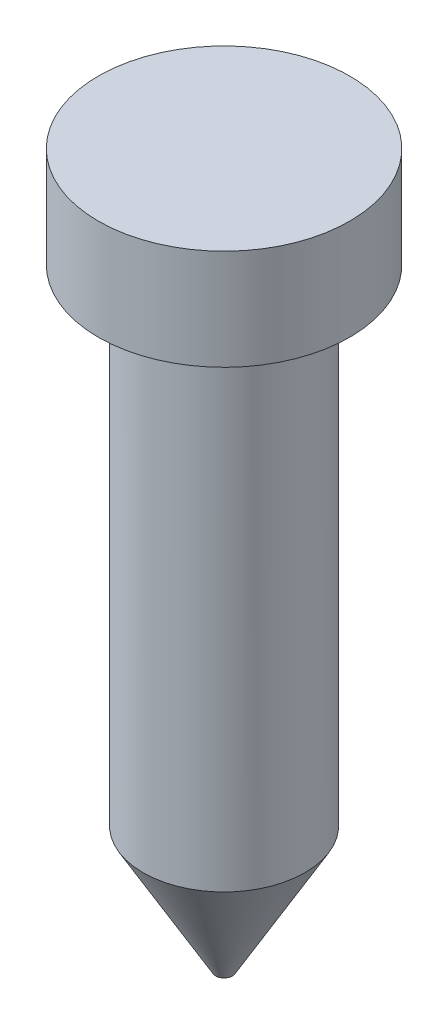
from build123d import *

# Parameters (mm, degrees)
SKETCH1_R      = 1.4732
EXTRUDE1_DEPTH = 11.1252
SKETCH2_R      = 2.286
EXTRUDE2_DEPTH = 1.8288
CHAMFER1_SIZE  = 1.3208
CHAMFER1_SIZE2 = 2.287692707


with BuildPart() as part:
    # Sketch1 → Extrude1 (new body)
    with BuildSketch(Plane(origin=(0, 0, 0), x_dir=(1, 0, 0), z_dir=(0, 1, 0))):
        with Locations(Location((0, 0, 0), (0, 0, 90))):
            Circle(SKETCH1_R)
    extrude(amount=EXTRUDE1_DEPTH)

    # Sketch2 → Extrude2 (add)
    with BuildSketch(Plane(origin=(0, 11.1252, 0), x_dir=(-1, 0, 0), z_dir=(0, 1, 0))):
        with Locations(Location((0, 0, 0), (0, 0, 90))):
            Circle(SKETCH2_R)
    extrude(amount=EXTRUDE2_DEPTH)

    # Chamfer1
    chamfer1_edges = [part.edges().sort_by_distance(p)[0] for p in [
        (0, 0, 1.4732),
    ]]
    chamfer1_side = [part.faces().sort_by_distance(p)[0] for p in [
        (0, 0, 0),
    ]]
    chamfer(chamfer1_edges, length=CHAMFER1_SIZE, length2=CHAMFER1_SIZE2, reference=chamfer1_side[0])


solid = part.part
